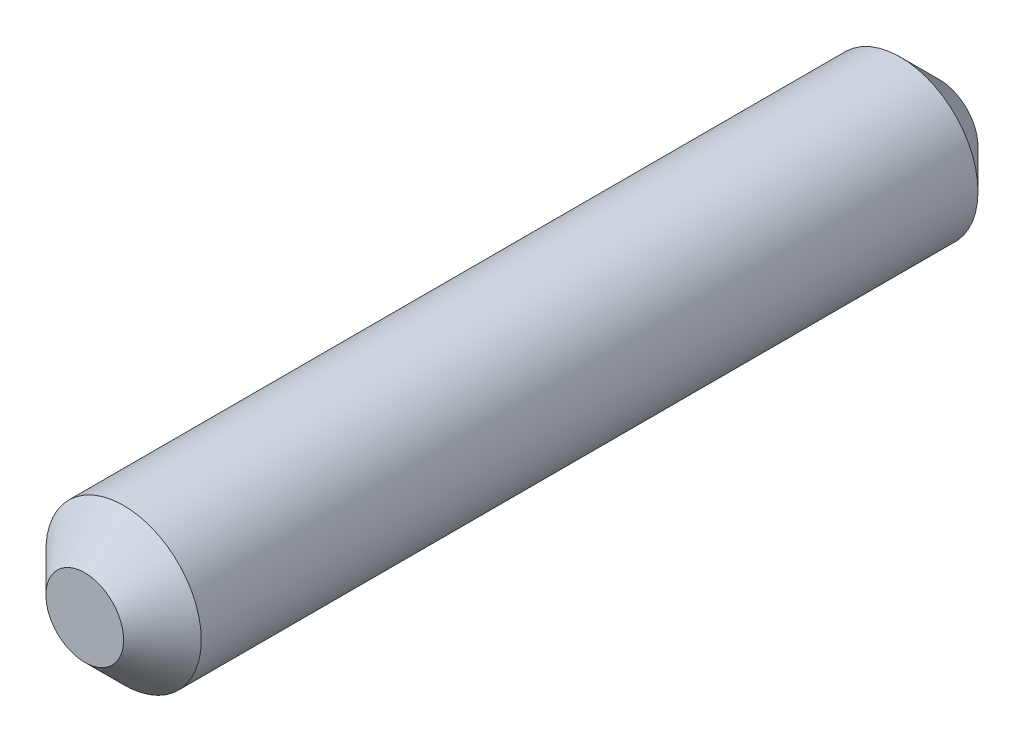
from build123d import *

# Parameters (mm, degrees)
SKETCH1_R           = 1
BOSS_EXTRUDE1_DEPTH = 11
CHAMFER1_SIZE       = 0.5


with BuildPart() as part:
    # Sketch1 → Boss-Extrude1 (new body)
    with BuildSketch(Plane.XY):
        Circle(SKETCH1_R)
    extrude(amount=BOSS_EXTRUDE1_DEPTH)

    # Chamfer1
    chamfer1_edges = [part.edges().sort_by_distance(p)[0] for p in [
        (-1, 0, 0),
        (-1, 0, 11),
    ]]
    chamfer(chamfer1_edges, length=CHAMFER1_SIZE)


solid = part.part
